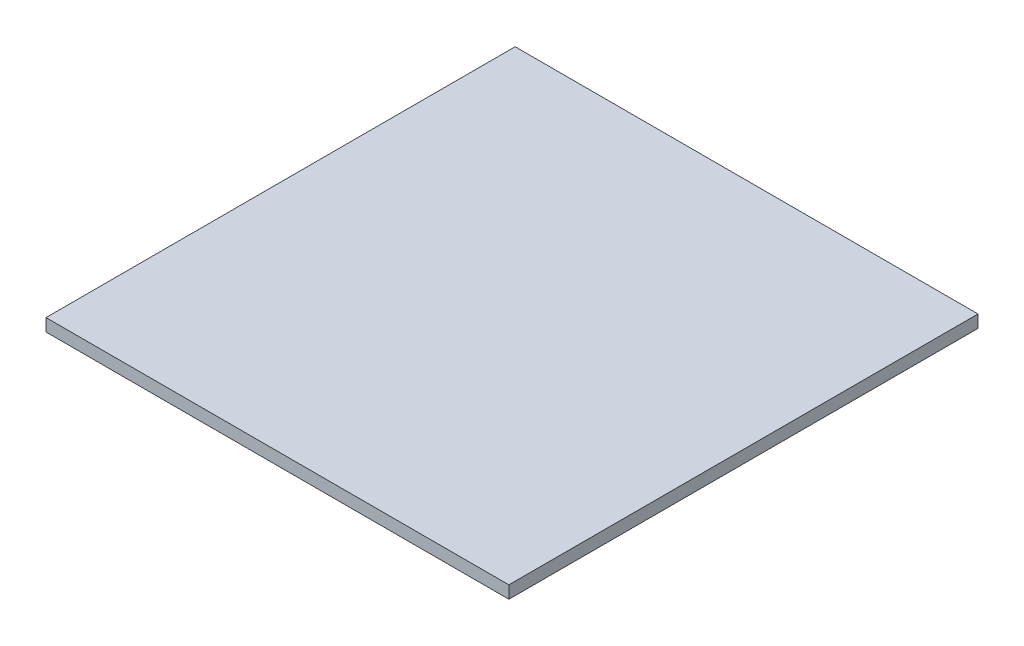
ISO-10303-21;
HEADER;
FILE_DESCRIPTION(('STEP AP214'),'2;1');
FILE_NAME('part.step','',(''),(''),'','','');
FILE_SCHEMA(('AUTOMOTIVE_DESIGN { 1 0 10303 214 1 1 1 1 }'));
ENDSEC;
DATA;
#1=APPLICATION_CONTEXT('core data for automotive mechanical design processes');
#2=APPLICATION_PROTOCOL_DEFINITION('international standard','automotive_design',2000,#1);
#3=PRODUCT_CONTEXT('',#1,'mechanical');
#4=PRODUCT('Part','Part','',(#3));
#5=PRODUCT_RELATED_PRODUCT_CATEGORY('part','',(#4));
#6=PRODUCT_DEFINITION_FORMATION('','',#4);
#7=PRODUCT_DEFINITION_CONTEXT('part definition',#1,'design');
#8=PRODUCT_DEFINITION('design','',#6,#7);
#9=PRODUCT_DEFINITION_SHAPE('','',#8);
#10=(LENGTH_UNIT() NAMED_UNIT(*) SI_UNIT(.MILLI.,.METRE.));
#11=(NAMED_UNIT(*) PLANE_ANGLE_UNIT() SI_UNIT($,.RADIAN.));
#12=(NAMED_UNIT(*) SI_UNIT($,.STERADIAN.) SOLID_ANGLE_UNIT());
#13=UNCERTAINTY_MEASURE_WITH_UNIT(LENGTH_MEASURE(1.E-05),#10,'distance_accuracy_value','');
#14=(GEOMETRIC_REPRESENTATION_CONTEXT(3) GLOBAL_UNCERTAINTY_ASSIGNED_CONTEXT((#13)) GLOBAL_UNIT_ASSIGNED_CONTEXT((#10,
#11,#12)) REPRESENTATION_CONTEXT('',''));
#15=CARTESIAN_POINT('',(0.,0.,0.));
#16=DIRECTION('',(0.,0.,1.));
#17=DIRECTION('',(1.,0.,0.));
#18=AXIS2_PLACEMENT_3D('',#15,#16,#17);
#19=CARTESIAN_POINT('',(0.,2.,0.));
#20=DIRECTION('',(1.,0.,0.));
#21=DIRECTION('',(0.,0.,-1.));
#22=AXIS2_PLACEMENT_3D('',#19,#20,#21);
#23=PLANE('',#22);
#24=DIRECTION('',(0.,0.,1.));
#25=VECTOR('',#24,1.);
#26=CARTESIAN_POINT('',(0.,0.,0.));
#27=LINE('',#26,#25);
#28=CARTESIAN_POINT('',(0.,0.,-75.));
#29=VERTEX_POINT('',#28);
#30=CARTESIAN_POINT('',(0.,0.,0.));
#31=VERTEX_POINT('',#30);
#32=EDGE_CURVE('E74',#29,#31,#27,.T.);
#33=ORIENTED_EDGE('',*,*,#32,.T.);
#34=DIRECTION('',(0.,-1.,0.));
#35=VECTOR('',#34,1.);
#36=CARTESIAN_POINT('',(0.,2.,0.));
#37=LINE('',#36,#35);
#38=CARTESIAN_POINT('',(0.,2.,0.));
#39=VERTEX_POINT('',#38);
#40=EDGE_CURVE('E11',#39,#31,#37,.T.);
#41=ORIENTED_EDGE('',*,*,#40,.F.);
#42=DIRECTION('',(0.,0.,1.));
#43=VECTOR('',#42,1.);
#44=CARTESIAN_POINT('',(0.,2.,0.));
#45=LINE('',#44,#43);
#46=CARTESIAN_POINT('',(0.,2.,-75.));
#47=VERTEX_POINT('',#46);
#48=EDGE_CURVE('E92',#47,#39,#45,.T.);
#49=ORIENTED_EDGE('',*,*,#48,.F.);
#50=DIRECTION('',(0.,-1.,0.));
#51=VECTOR('',#50,1.);
#52=CARTESIAN_POINT('',(0.,2.,-75.));
#53=LINE('',#52,#51);
#54=EDGE_CURVE('E86',#47,#29,#53,.T.);
#55=ORIENTED_EDGE('',*,*,#54,.T.);
#56=EDGE_LOOP('',(#33,#41,#49,#55));
#57=FACE_BOUND('',#56,.T.);
#58=ADVANCED_FACE('F30',(#57),#23,.F.);
#59=CARTESIAN_POINT('',(0.,2.,0.));
#60=DIRECTION('',(0.,0.,-1.));
#61=DIRECTION('',(-1.,0.,0.));
#62=AXIS2_PLACEMENT_3D('',#59,#60,#61);
#63=PLANE('',#62);
#64=DIRECTION('',(1.,0.,0.));
#65=VECTOR('',#64,1.);
#66=CARTESIAN_POINT('',(0.,0.,0.));
#67=LINE('',#66,#65);
#68=CARTESIAN_POINT('',(74.,0.,0.));
#69=VERTEX_POINT('',#68);
#70=EDGE_CURVE('E70',#31,#69,#67,.T.);
#71=ORIENTED_EDGE('',*,*,#70,.T.);
#72=DIRECTION('',(0.,-1.,0.));
#73=VECTOR('',#72,1.);
#74=CARTESIAN_POINT('',(74.,2.,0.));
#75=LINE('',#74,#73);
#76=CARTESIAN_POINT('',(74.,2.,0.));
#77=VERTEX_POINT('',#76);
#78=EDGE_CURVE('E37',#77,#69,#75,.T.);
#79=ORIENTED_EDGE('',*,*,#78,.F.);
#80=DIRECTION('',(1.,0.,0.));
#81=VECTOR('',#80,1.);
#82=CARTESIAN_POINT('',(0.,2.,0.));
#83=LINE('',#82,#81);
#84=EDGE_CURVE('E82',#39,#77,#83,.T.);
#85=ORIENTED_EDGE('',*,*,#84,.F.);
#86=ORIENTED_EDGE('',*,*,#40,.T.);
#87=EDGE_LOOP('',(#71,#79,#85,#86));
#88=FACE_BOUND('',#87,.T.);
#89=ADVANCED_FACE('F81',(#88),#63,.F.);
#90=CARTESIAN_POINT('',(74.,2.,0.));
#91=DIRECTION('',(-1.,0.,0.));
#92=DIRECTION('',(0.,0.,1.));
#93=AXIS2_PLACEMENT_3D('',#90,#91,#92);
#94=PLANE('',#93);
#95=DIRECTION('',(0.,0.,-1.));
#96=VECTOR('',#95,1.);
#97=CARTESIAN_POINT('',(74.,0.,0.));
#98=LINE('',#97,#96);
#99=CARTESIAN_POINT('',(74.,0.,-75.));
#100=VERTEX_POINT('',#99);
#101=EDGE_CURVE('E75',#69,#100,#98,.T.);
#102=ORIENTED_EDGE('',*,*,#101,.T.);
#103=DIRECTION('',(0.,-1.,0.));
#104=VECTOR('',#103,1.);
#105=CARTESIAN_POINT('',(74.,2.,-75.));
#106=LINE('',#105,#104);
#107=CARTESIAN_POINT('',(74.,2.,-75.));
#108=VERTEX_POINT('',#107);
#109=EDGE_CURVE('E98',#108,#100,#106,.T.);
#110=ORIENTED_EDGE('',*,*,#109,.F.);
#111=DIRECTION('',(0.,0.,-1.));
#112=VECTOR('',#111,1.);
#113=CARTESIAN_POINT('',(74.,2.,0.));
#114=LINE('',#113,#112);
#115=EDGE_CURVE('E49',#77,#108,#114,.T.);
#116=ORIENTED_EDGE('',*,*,#115,.F.);
#117=ORIENTED_EDGE('',*,*,#78,.T.);
#118=EDGE_LOOP('',(#102,#110,#116,#117));
#119=FACE_BOUND('',#118,.T.);
#120=ADVANCED_FACE('F101',(#119),#94,.F.);
#121=CARTESIAN_POINT('',(0.,2.,-75.));
#122=DIRECTION('',(0.,0.,1.));
#123=DIRECTION('',(1.,0.,0.));
#124=AXIS2_PLACEMENT_3D('',#121,#122,#123);
#125=PLANE('',#124);
#126=DIRECTION('',(-1.,0.,0.));
#127=VECTOR('',#126,1.);
#128=CARTESIAN_POINT('',(0.,0.,-75.));
#129=LINE('',#128,#127);
#130=EDGE_CURVE('E90',#100,#29,#129,.T.);
#131=ORIENTED_EDGE('',*,*,#130,.T.);
#132=ORIENTED_EDGE('',*,*,#54,.F.);
#133=DIRECTION('',(-1.,0.,0.));
#134=VECTOR('',#133,1.);
#135=CARTESIAN_POINT('',(0.,2.,-75.));
#136=LINE('',#135,#134);
#137=EDGE_CURVE('E44',#108,#47,#136,.T.);
#138=ORIENTED_EDGE('',*,*,#137,.F.);
#139=ORIENTED_EDGE('',*,*,#109,.T.);
#140=EDGE_LOOP('',(#131,#132,#138,#139));
#141=FACE_BOUND('',#140,.T.);
#142=ADVANCED_FACE('F103',(#141),#125,.F.);
#143=CARTESIAN_POINT('',(0.,2.,-75.));
#144=DIRECTION('',(0.,-1.,0.));
#145=DIRECTION('',(0.,0.,-1.));
#146=AXIS2_PLACEMENT_3D('',#143,#144,#145);
#147=PLANE('',#146);
#148=ORIENTED_EDGE('',*,*,#48,.T.);
#149=ORIENTED_EDGE('',*,*,#84,.T.);
#150=ORIENTED_EDGE('',*,*,#115,.T.);
#151=ORIENTED_EDGE('',*,*,#137,.T.);
#152=EDGE_LOOP('',(#148,#149,#150,#151));
#153=FACE_BOUND('',#152,.T.);
#154=ADVANCED_FACE('F104',(#153),#147,.F.);
#155=CARTESIAN_POINT('',(0.,0.,-75.));
#156=DIRECTION('',(0.,-1.,0.));
#157=DIRECTION('',(0.,0.,-1.));
#158=AXIS2_PLACEMENT_3D('',#155,#156,#157);
#159=PLANE('',#158);
#160=ORIENTED_EDGE('',*,*,#32,.F.);
#161=ORIENTED_EDGE('',*,*,#130,.F.);
#162=ORIENTED_EDGE('',*,*,#101,.F.);
#163=ORIENTED_EDGE('',*,*,#70,.F.);
#164=EDGE_LOOP('',(#160,#161,#162,#163));
#165=FACE_BOUND('',#164,.T.);
#166=ADVANCED_FACE('F71',(#165),#159,.T.);
#167=CLOSED_SHELL('',(#58,#89,#120,#142,#154,#166));
#168=MANIFOLD_SOLID_BREP('B2',#167);
#169=ADVANCED_BREP_SHAPE_REPRESENTATION('',(#18,#168),#14);
#170=SHAPE_DEFINITION_REPRESENTATION(#9,#169);
ENDSEC;
END-ISO-10303-21;
